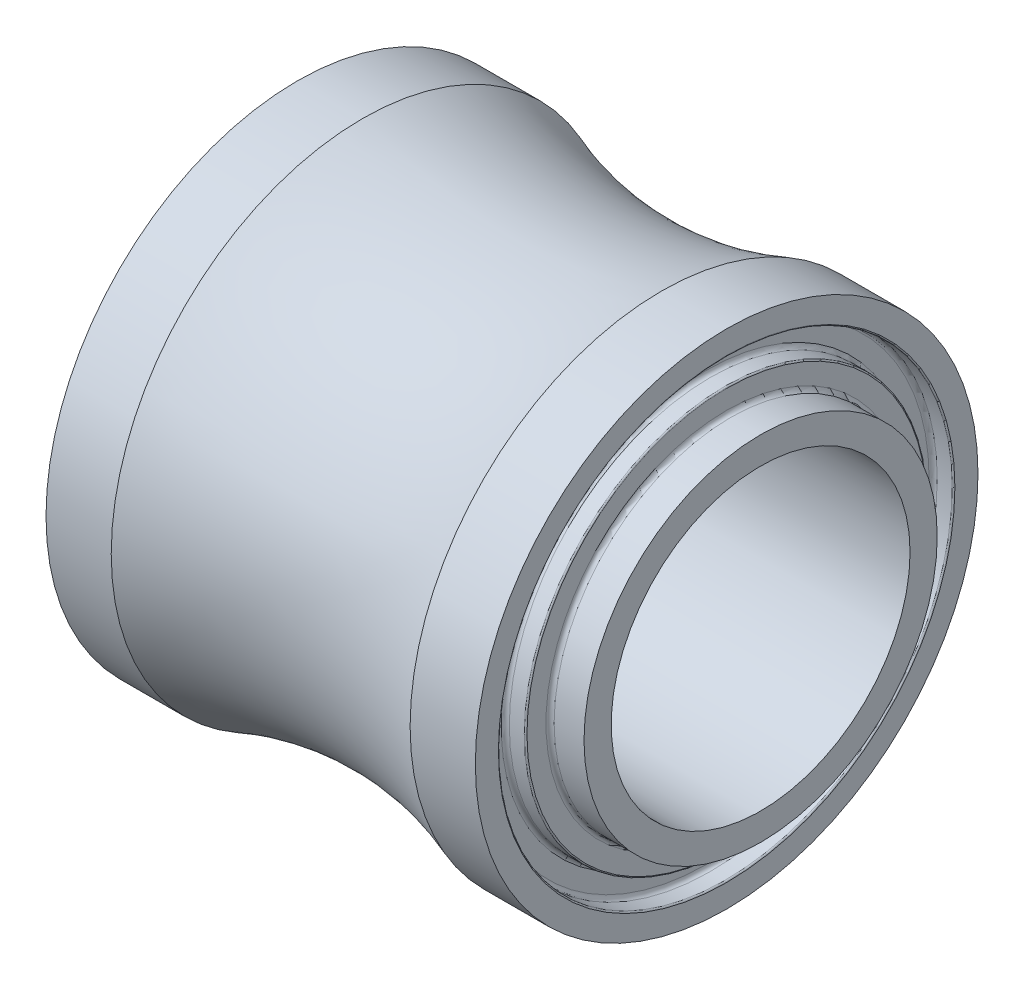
ISO-10303-21;
HEADER;
FILE_DESCRIPTION(('STEP AP214'),'2;1');
FILE_NAME('part.step','',(''),(''),'','','');
FILE_SCHEMA(('AUTOMOTIVE_DESIGN { 1 0 10303 214 1 1 1 1 }'));
ENDSEC;
DATA;
#1=APPLICATION_CONTEXT('core data for automotive mechanical design processes');
#2=APPLICATION_PROTOCOL_DEFINITION('international standard','automotive_design',2000,#1);
#3=PRODUCT_CONTEXT('',#1,'mechanical');
#4=PRODUCT('Part','Part','',(#3));
#5=PRODUCT_RELATED_PRODUCT_CATEGORY('part','',(#4));
#6=PRODUCT_DEFINITION_FORMATION('','',#4);
#7=PRODUCT_DEFINITION_CONTEXT('part definition',#1,'design');
#8=PRODUCT_DEFINITION('design','',#6,#7);
#9=PRODUCT_DEFINITION_SHAPE('','',#8);
#10=(LENGTH_UNIT() NAMED_UNIT(*) SI_UNIT(.MILLI.,.METRE.));
#11=(NAMED_UNIT(*) PLANE_ANGLE_UNIT() SI_UNIT($,.RADIAN.));
#12=(NAMED_UNIT(*) SI_UNIT($,.STERADIAN.) SOLID_ANGLE_UNIT());
#13=UNCERTAINTY_MEASURE_WITH_UNIT(LENGTH_MEASURE(1.E-05),#10,'distance_accuracy_value','');
#14=(GEOMETRIC_REPRESENTATION_CONTEXT(3) GLOBAL_UNCERTAINTY_ASSIGNED_CONTEXT((#13)) GLOBAL_UNIT_ASSIGNED_CONTEXT((#10,
#11,#12)) REPRESENTATION_CONTEXT('',''));
#15=CARTESIAN_POINT('',(0.,0.,0.));
#16=DIRECTION('',(0.,0.,1.));
#17=DIRECTION('',(1.,0.,0.));
#18=AXIS2_PLACEMENT_3D('',#15,#16,#17);
#19=CARTESIAN_POINT('',(-15.8,0.,0.));
#20=DIRECTION('',(1.,0.,0.));
#21=DIRECTION('',(0.,0.,-1.));
#22=AXIS2_PLACEMENT_3D('',#19,#20,#21);
#23=CYLINDRICAL_SURFACE('',#22,18.5);
#24=CARTESIAN_POINT('',(-15.8,0.,0.));
#25=DIRECTION('',(1.,0.,0.));
#26=DIRECTION('',(0.,0.,-1.));
#27=AXIS2_PLACEMENT_3D('',#24,#25,#26);
#28=CIRCLE('',#27,18.5);
#29=CARTESIAN_POINT('',(-15.8,0.,-18.5));
#30=VERTEX_POINT('',#29);
#31=EDGE_CURVE('E358',#30,#30,#28,.T.);
#32=ORIENTED_EDGE('',*,*,#31,.T.);
#33=EDGE_LOOP('',(#32));
#34=FACE_BOUND('',#33,.T.);
#35=CARTESIAN_POINT('',(-10.9999999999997,0.,0.));
#36=DIRECTION('',(1.,0.,0.));
#37=DIRECTION('',(0.,-1.,0.));
#38=AXIS2_PLACEMENT_3D('',#35,#36,#37);
#39=CIRCLE('',#38,18.5000000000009);
#40=CARTESIAN_POINT('',(-10.9999999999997,-18.5000000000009,0.));
#41=VERTEX_POINT('',#40);
#42=EDGE_CURVE('E361',#41,#41,#39,.F.);
#43=ORIENTED_EDGE('',*,*,#42,.T.);
#44=EDGE_LOOP('',(#43));
#45=FACE_BOUND('',#44,.T.);
#46=ADVANCED_FACE('F14',(#34,#45),#23,.T.);
#47=CARTESIAN_POINT('',(0.,0.,0.));
#48=DIRECTION('',(1.,0.,0.));
#49=DIRECTION('',(0.,-1.,0.));
#50=AXIS2_PLACEMENT_3D('',#47,#48,#49);
#51=TOROIDAL_SURFACE('',#50,47.80341277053,31.3);
#52=ORIENTED_EDGE('',*,*,#42,.F.);
#53=EDGE_LOOP('',(#52));
#54=FACE_BOUND('',#53,.T.);
#55=CARTESIAN_POINT('',(11.,0.,0.));
#56=DIRECTION('',(1.,0.,0.));
#57=DIRECTION('',(0.,-1.,0.));
#58=AXIS2_PLACEMENT_3D('',#55,#56,#57);
#59=CIRCLE('',#58,18.5);
#60=CARTESIAN_POINT('',(11.,-18.5,0.));
#61=VERTEX_POINT('',#60);
#62=EDGE_CURVE('E99',#61,#61,#59,.T.);
#63=ORIENTED_EDGE('',*,*,#62,.F.);
#64=EDGE_LOOP('',(#63));
#65=FACE_BOUND('',#64,.T.);
#66=ADVANCED_FACE('F504',(#54,#65),#51,.F.);
#67=CARTESIAN_POINT('',(-15.8,0.,0.));
#68=DIRECTION('',(1.,0.,0.));
#69=DIRECTION('',(0.,0.,-1.));
#70=AXIS2_PLACEMENT_3D('',#67,#68,#69);
#71=PLANE('',#70);
#72=CARTESIAN_POINT('',(-15.8,0.,0.));
#73=DIRECTION('',(-1.,0.,0.));
#74=DIRECTION('',(0.,1.,0.));
#75=AXIS2_PLACEMENT_3D('',#72,#73,#74);
#76=CIRCLE('',#75,16.79999997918);
#77=CARTESIAN_POINT('',(-15.8,16.799999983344,0.));
#78=VERTEX_POINT('',#77);
#79=CARTESIAN_POINT('',(-15.8,-16.799999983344,0.));
#80=VERTEX_POINT('',#79);
#81=EDGE_CURVE('E91',#78,#80,#76,.T.);
#82=ORIENTED_EDGE('',*,*,#81,.F.);
#83=CARTESIAN_POINT('',(-15.8,0.,0.));
#84=DIRECTION('',(-1.,0.,0.));
#85=DIRECTION('',(0.,-1.,0.));
#86=AXIS2_PLACEMENT_3D('',#83,#84,#85);
#87=CIRCLE('',#86,16.79999998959);
#88=EDGE_CURVE('E97',#80,#78,#87,.T.);
#89=ORIENTED_EDGE('',*,*,#88,.F.);
#90=EDGE_LOOP('',(#82,#89));
#91=FACE_BOUND('',#90,.T.);
#92=ORIENTED_EDGE('',*,*,#31,.F.);
#93=EDGE_LOOP('',(#92));
#94=FACE_BOUND('',#93,.T.);
#95=ADVANCED_FACE('F95',(#91,#94),#71,.F.);
#96=CARTESIAN_POINT('',(11.,0.,0.));
#97=DIRECTION('',(1.,0.,0.));
#98=DIRECTION('',(0.,0.,-1.));
#99=AXIS2_PLACEMENT_3D('',#96,#97,#98);
#100=CYLINDRICAL_SURFACE('',#99,18.5);
#101=ORIENTED_EDGE('',*,*,#62,.T.);
#102=EDGE_LOOP('',(#101));
#103=FACE_BOUND('',#102,.T.);
#104=CARTESIAN_POINT('',(15.8,0.,0.));
#105=DIRECTION('',(1.,0.,0.));
#106=DIRECTION('',(0.,0.,-1.));
#107=AXIS2_PLACEMENT_3D('',#104,#105,#106);
#108=CIRCLE('',#107,18.5);
#109=CARTESIAN_POINT('',(15.8,0.,-18.5));
#110=VERTEX_POINT('',#109);
#111=EDGE_CURVE('E104',#110,#110,#108,.T.);
#112=ORIENTED_EDGE('',*,*,#111,.F.);
#113=EDGE_LOOP('',(#112));
#114=FACE_BOUND('',#113,.T.);
#115=ADVANCED_FACE('F124',(#103,#114),#100,.T.);
#116=CARTESIAN_POINT('',(-15.7,0.,0.));
#117=DIRECTION('',(-1.,0.,0.));
#118=DIRECTION('',(0.,0.999965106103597,-0.00835383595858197));
#119=AXIS2_PLACEMENT_3D('',#116,#117,#118);
#120=TOROIDAL_SURFACE('',#119,16.8,0.1);
#121=CARTESIAN_POINT('',(-15.7,0.,0.));
#122=DIRECTION('',(-1.,0.,0.));
#123=DIRECTION('',(0.,1.,0.));
#124=AXIS2_PLACEMENT_3D('',#121,#122,#123);
#125=CIRCLE('',#124,16.7);
#126=CARTESIAN_POINT('',(-15.7,16.7,0.));
#127=VERTEX_POINT('',#126);
#128=EDGE_CURVE('E107',#127,#127,#125,.F.);
#129=ORIENTED_EDGE('',*,*,#128,.T.);
#130=EDGE_LOOP('',(#129));
#131=FACE_BOUND('',#130,.T.);
#132=ORIENTED_EDGE('',*,*,#88,.T.);
#133=ORIENTED_EDGE('',*,*,#81,.T.);
#134=EDGE_LOOP('',(#132,#133));
#135=FACE_BOUND('',#134,.T.);
#136=ADVANCED_FACE('F103',(#131,#135),#120,.T.);
#137=CARTESIAN_POINT('',(15.8,0.,0.));
#138=DIRECTION('',(1.,0.,0.));
#139=DIRECTION('',(0.,0.,-1.));
#140=AXIS2_PLACEMENT_3D('',#137,#138,#139);
#141=PLANE('',#140);
#142=CARTESIAN_POINT('',(15.8,0.,0.));
#143=DIRECTION('',(1.,0.,0.));
#144=DIRECTION('',(0.,-1.,0.));
#145=AXIS2_PLACEMENT_3D('',#142,#143,#144);
#146=CIRCLE('',#145,16.79999998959);
#147=CARTESIAN_POINT('',(15.8,-16.799999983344,0.));
#148=VERTEX_POINT('',#147);
#149=CARTESIAN_POINT('',(15.8,16.799999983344,0.));
#150=VERTEX_POINT('',#149);
#151=EDGE_CURVE('E139',#148,#150,#146,.T.);
#152=ORIENTED_EDGE('',*,*,#151,.F.);
#153=CARTESIAN_POINT('',(15.8,0.,0.));
#154=DIRECTION('',(1.,0.,0.));
#155=DIRECTION('',(0.,1.,0.));
#156=AXIS2_PLACEMENT_3D('',#153,#154,#155);
#157=CIRCLE('',#156,16.79999997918);
#158=EDGE_CURVE('E149',#150,#148,#157,.T.);
#159=ORIENTED_EDGE('',*,*,#158,.F.);
#160=EDGE_LOOP('',(#152,#159));
#161=FACE_BOUND('',#160,.T.);
#162=ORIENTED_EDGE('',*,*,#111,.T.);
#163=EDGE_LOOP('',(#162));
#164=FACE_BOUND('',#163,.T.);
#165=ADVANCED_FACE('F123',(#161,#164),#141,.T.);
#166=CARTESIAN_POINT('',(-14.6,0.,0.));
#167=DIRECTION('',(-1.,0.,0.));
#168=DIRECTION('',(0.,0.,1.));
#169=AXIS2_PLACEMENT_3D('',#166,#167,#168);
#170=CYLINDRICAL_SURFACE('',#169,16.7);
#171=CARTESIAN_POINT('',(-14.6,0.,0.));
#172=DIRECTION('',(-1.,0.,0.));
#173=DIRECTION('',(0.,-0.999981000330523,-0.00616433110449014));
#174=AXIS2_PLACEMENT_3D('',#171,#172,#173);
#175=CIRCLE('',#174,16.7);
#176=CARTESIAN_POINT('',(-14.6,-16.6996827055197,-0.102944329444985));
#177=VERTEX_POINT('',#176);
#178=EDGE_CURVE('E346',#177,#177,#175,.F.);
#179=ORIENTED_EDGE('',*,*,#178,.T.);
#180=EDGE_LOOP('',(#179));
#181=FACE_BOUND('',#180,.T.);
#182=ORIENTED_EDGE('',*,*,#128,.F.);
#183=EDGE_LOOP('',(#182));
#184=FACE_BOUND('',#183,.T.);
#185=ADVANCED_FACE('F168',(#181,#184),#170,.F.);
#186=CARTESIAN_POINT('',(15.7,0.,0.));
#187=DIRECTION('',(-1.,0.,0.));
#188=DIRECTION('',(0.,0.999982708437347,0.00588071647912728));
#189=AXIS2_PLACEMENT_3D('',#186,#187,#188);
#190=TOROIDAL_SURFACE('',#189,16.8,0.1);
#191=CARTESIAN_POINT('',(15.7,0.,0.));
#192=DIRECTION('',(-1.,0.,0.));
#193=DIRECTION('',(0.,1.,0.));
#194=AXIS2_PLACEMENT_3D('',#191,#192,#193);
#195=CIRCLE('',#194,16.7);
#196=CARTESIAN_POINT('',(15.7,16.7,0.));
#197=VERTEX_POINT('',#196);
#198=EDGE_CURVE('E338',#197,#197,#195,.T.);
#199=ORIENTED_EDGE('',*,*,#198,.T.);
#200=EDGE_LOOP('',(#199));
#201=FACE_BOUND('',#200,.T.);
#202=ORIENTED_EDGE('',*,*,#151,.T.);
#203=ORIENTED_EDGE('',*,*,#158,.T.);
#204=EDGE_LOOP('',(#202,#203));
#205=FACE_BOUND('',#204,.T.);
#206=ADVANCED_FACE('F163',(#201,#205),#190,.T.);
#207=CARTESIAN_POINT('',(-14.6,0.,0.));
#208=DIRECTION('',(-1.,0.,0.));
#209=DIRECTION('',(0.,-0.999981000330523,-0.00616433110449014));
#210=AXIS2_PLACEMENT_3D('',#207,#208,#209);
#211=TOROIDAL_SURFACE('',#210,16.4,0.3);
#212=CARTESIAN_POINT('',(-14.3,0.,0.));
#213=DIRECTION('',(1.,0.,0.));
#214=DIRECTION('',(0.,1.,0.));
#215=AXIS2_PLACEMENT_3D('',#212,#213,#214);
#216=CIRCLE('',#215,16.40000001);
#217=CARTESIAN_POINT('',(-14.3,-16.400000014,0.));
#218=VERTEX_POINT('',#217);
#219=CARTESIAN_POINT('',(-14.3,16.400000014,0.));
#220=VERTEX_POINT('',#219);
#221=EDGE_CURVE('E326',#218,#220,#216,.F.);
#222=ORIENTED_EDGE('',*,*,#221,.F.);
#223=CARTESIAN_POINT('',(-14.3,0.,0.));
#224=DIRECTION('',(1.,0.,0.));
#225=DIRECTION('',(0.,-1.,0.));
#226=AXIS2_PLACEMENT_3D('',#223,#224,#225);
#227=CIRCLE('',#226,16.40000002);
#228=EDGE_CURVE('E198',#220,#218,#227,.F.);
#229=ORIENTED_EDGE('',*,*,#228,.F.);
#230=EDGE_LOOP('',(#222,#229));
#231=FACE_BOUND('',#230,.T.);
#232=ORIENTED_EDGE('',*,*,#178,.F.);
#233=EDGE_LOOP('',(#232));
#234=FACE_BOUND('',#233,.T.);
#235=ADVANCED_FACE('F167',(#231,#234),#211,.F.);
#236=CARTESIAN_POINT('',(15.7,0.,0.));
#237=DIRECTION('',(-1.,0.,0.));
#238=DIRECTION('',(0.,0.,1.));
#239=AXIS2_PLACEMENT_3D('',#236,#237,#238);
#240=CYLINDRICAL_SURFACE('',#239,16.7);
#241=CARTESIAN_POINT('',(14.6,0.,0.));
#242=DIRECTION('',(-1.,0.,0.));
#243=DIRECTION('',(0.,-0.999984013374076,0.00565446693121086));
#244=AXIS2_PLACEMENT_3D('',#241,#242,#243);
#245=CIRCLE('',#244,16.7);
#246=CARTESIAN_POINT('',(14.6,-16.6997330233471,0.0944295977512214));
#247=VERTEX_POINT('',#246);
#248=EDGE_CURVE('E324',#247,#247,#245,.T.);
#249=ORIENTED_EDGE('',*,*,#248,.T.);
#250=EDGE_LOOP('',(#249));
#251=FACE_BOUND('',#250,.T.);
#252=ORIENTED_EDGE('',*,*,#198,.F.);
#253=EDGE_LOOP('',(#252));
#254=FACE_BOUND('',#253,.T.);
#255=ADVANCED_FACE('F677',(#251,#254),#240,.F.);
#256=CARTESIAN_POINT('',(-14.3,0.,0.));
#257=DIRECTION('',(-1.,0.,0.));
#258=DIRECTION('',(0.,0.,1.));
#259=AXIS2_PLACEMENT_3D('',#256,#257,#258);
#260=PLANE('',#259);
#261=CARTESIAN_POINT('',(-14.3,0.,0.));
#262=DIRECTION('',(-1.,0.,0.));
#263=DIRECTION('',(0.,1.,0.));
#264=AXIS2_PLACEMENT_3D('',#261,#262,#263);
#265=CIRCLE('',#264,15.0999999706);
#266=CARTESIAN_POINT('',(-14.3,-15.09999997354,0.));
#267=VERTEX_POINT('',#266);
#268=CARTESIAN_POINT('',(-14.3,15.09999997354,0.));
#269=VERTEX_POINT('',#268);
#270=EDGE_CURVE('E312',#267,#269,#265,.F.);
#271=ORIENTED_EDGE('',*,*,#270,.T.);
#272=CARTESIAN_POINT('',(-14.3,0.,0.));
#273=DIRECTION('',(-1.,0.,0.));
#274=DIRECTION('',(0.,-1.,0.));
#275=AXIS2_PLACEMENT_3D('',#272,#273,#274);
#276=CIRCLE('',#275,15.0999999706);
#277=EDGE_CURVE('E320',#269,#267,#276,.F.);
#278=ORIENTED_EDGE('',*,*,#277,.T.);
#279=EDGE_LOOP('',(#271,#278));
#280=FACE_BOUND('',#279,.T.);
#281=ORIENTED_EDGE('',*,*,#228,.T.);
#282=ORIENTED_EDGE('',*,*,#221,.T.);
#283=EDGE_LOOP('',(#281,#282));
#284=FACE_BOUND('',#283,.T.);
#285=ADVANCED_FACE('F217',(#280,#284),#260,.T.);
#286=CARTESIAN_POINT('',(14.6,0.,0.));
#287=DIRECTION('',(-1.,0.,0.));
#288=DIRECTION('',(0.,-0.999984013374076,0.00565446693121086));
#289=AXIS2_PLACEMENT_3D('',#286,#287,#288);
#290=TOROIDAL_SURFACE('',#289,16.4,0.3);
#291=CARTESIAN_POINT('',(14.3,0.,0.));
#292=DIRECTION('',(-1.,0.,0.));
#293=DIRECTION('',(0.,1.,0.));
#294=AXIS2_PLACEMENT_3D('',#291,#292,#293);
#295=CIRCLE('',#294,16.40000001);
#296=CARTESIAN_POINT('',(14.3,16.400000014,0.));
#297=VERTEX_POINT('',#296);
#298=CARTESIAN_POINT('',(14.3,-16.400000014,0.));
#299=VERTEX_POINT('',#298);
#300=EDGE_CURVE('E814',#297,#299,#295,.T.);
#301=ORIENTED_EDGE('',*,*,#300,.T.);
#302=CARTESIAN_POINT('',(14.3,0.,0.));
#303=DIRECTION('',(-1.,0.,0.));
#304=DIRECTION('',(0.,-1.,0.));
#305=AXIS2_PLACEMENT_3D('',#302,#303,#304);
#306=CIRCLE('',#305,16.40000002);
#307=EDGE_CURVE('E236',#299,#297,#306,.T.);
#308=ORIENTED_EDGE('',*,*,#307,.T.);
#309=EDGE_LOOP('',(#301,#308));
#310=FACE_BOUND('',#309,.T.);
#311=ORIENTED_EDGE('',*,*,#248,.F.);
#312=EDGE_LOOP('',(#311));
#313=FACE_BOUND('',#312,.T.);
#314=ADVANCED_FACE('F205',(#310,#313),#290,.F.);
#315=CARTESIAN_POINT('',(-14.6,0.,0.));
#316=DIRECTION('',(-1.,0.,0.));
#317=DIRECTION('',(0.,-0.999977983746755,-0.0066356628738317));
#318=AXIS2_PLACEMENT_3D('',#315,#316,#317);
#319=TOROIDAL_SURFACE('',#318,15.1,0.3);
#320=CARTESIAN_POINT('',(-14.6,0.,0.));
#321=DIRECTION('',(-1.,0.,0.));
#322=DIRECTION('',(0.,1.,0.));
#323=AXIS2_PLACEMENT_3D('',#320,#321,#322);
#324=CIRCLE('',#323,14.8);
#325=CARTESIAN_POINT('',(-14.6,14.8,0.));
#326=VERTEX_POINT('',#325);
#327=EDGE_CURVE('E812',#326,#326,#324,.T.);
#328=ORIENTED_EDGE('',*,*,#327,.F.);
#329=EDGE_LOOP('',(#328));
#330=FACE_BOUND('',#329,.T.);
#331=ORIENTED_EDGE('',*,*,#270,.F.);
#332=ORIENTED_EDGE('',*,*,#277,.F.);
#333=EDGE_LOOP('',(#331,#332));
#334=FACE_BOUND('',#333,.T.);
#335=ADVANCED_FACE('F216',(#330,#334),#319,.F.);
#336=CARTESIAN_POINT('',(14.3,0.,0.));
#337=DIRECTION('',(-1.,0.,0.));
#338=DIRECTION('',(0.,0.,1.));
#339=AXIS2_PLACEMENT_3D('',#336,#337,#338);
#340=PLANE('',#339);
#341=CARTESIAN_POINT('',(14.3,0.,0.));
#342=DIRECTION('',(1.,0.,0.));
#343=DIRECTION('',(0.,1.,0.));
#344=AXIS2_PLACEMENT_3D('',#341,#342,#343);
#345=CIRCLE('',#344,15.09999997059);
#346=CARTESIAN_POINT('',(14.3,-15.099999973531,0.));
#347=VERTEX_POINT('',#346);
#348=CARTESIAN_POINT('',(14.3,15.099999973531,0.));
#349=VERTEX_POINT('',#348);
#350=EDGE_CURVE('E810',#347,#349,#345,.F.);
#351=ORIENTED_EDGE('',*,*,#350,.T.);
#352=CARTESIAN_POINT('',(14.3,0.,0.));
#353=DIRECTION('',(1.,0.,0.));
#354=DIRECTION('',(0.,-1.,0.));
#355=AXIS2_PLACEMENT_3D('',#352,#353,#354);
#356=CIRCLE('',#355,15.09999997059);
#357=EDGE_CURVE('E270',#349,#347,#356,.F.);
#358=ORIENTED_EDGE('',*,*,#357,.T.);
#359=EDGE_LOOP('',(#351,#358));
#360=FACE_BOUND('',#359,.T.);
#361=ORIENTED_EDGE('',*,*,#307,.F.);
#362=ORIENTED_EDGE('',*,*,#300,.F.);
#363=EDGE_LOOP('',(#361,#362));
#364=FACE_BOUND('',#363,.T.);
#365=ADVANCED_FACE('F241',(#360,#364),#340,.F.);
#366=CARTESIAN_POINT('',(-14.6,0.,0.));
#367=DIRECTION('',(-1.,0.,0.));
#368=DIRECTION('',(0.,0.,1.));
#369=AXIS2_PLACEMENT_3D('',#366,#367,#368);
#370=CYLINDRICAL_SURFACE('',#369,14.8);
#371=ORIENTED_EDGE('',*,*,#327,.T.);
#372=EDGE_LOOP('',(#371));
#373=FACE_BOUND('',#372,.T.);
#374=CARTESIAN_POINT('',(-15.7,0.,0.));
#375=DIRECTION('',(-1.,0.,0.));
#376=DIRECTION('',(0.,-0.999977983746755,-0.0066356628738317));
#377=AXIS2_PLACEMENT_3D('',#374,#375,#376);
#378=CIRCLE('',#377,14.8);
#379=CARTESIAN_POINT('',(-15.7,-14.799674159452,-0.0982078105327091));
#380=VERTEX_POINT('',#379);
#381=EDGE_CURVE('E808',#380,#380,#378,.T.);
#382=ORIENTED_EDGE('',*,*,#381,.F.);
#383=EDGE_LOOP('',(#382));
#384=FACE_BOUND('',#383,.T.);
#385=ADVANCED_FACE('F250',(#373,#384),#370,.T.);
#386=CARTESIAN_POINT('',(14.6,0.,0.));
#387=DIRECTION('',(-1.,0.,0.));
#388=DIRECTION('',(0.,0.999955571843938,-0.00942625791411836));
#389=AXIS2_PLACEMENT_3D('',#386,#387,#388);
#390=TOROIDAL_SURFACE('',#389,15.1,0.3);
#391=CARTESIAN_POINT('',(14.6,0.,0.));
#392=DIRECTION('',(-1.,0.,0.));
#393=DIRECTION('',(0.,1.,0.));
#394=AXIS2_PLACEMENT_3D('',#391,#392,#393);
#395=CIRCLE('',#394,14.8);
#396=CARTESIAN_POINT('',(14.6,14.8,0.));
#397=VERTEX_POINT('',#396);
#398=EDGE_CURVE('E763',#397,#397,#395,.F.);
#399=ORIENTED_EDGE('',*,*,#398,.F.);
#400=EDGE_LOOP('',(#399));
#401=FACE_BOUND('',#400,.T.);
#402=ORIENTED_EDGE('',*,*,#357,.F.);
#403=ORIENTED_EDGE('',*,*,#350,.F.);
#404=EDGE_LOOP('',(#402,#403));
#405=FACE_BOUND('',#404,.T.);
#406=ADVANCED_FACE('F284',(#401,#405),#390,.F.);
#407=CARTESIAN_POINT('',(-15.7,0.,0.));
#408=DIRECTION('',(-1.,0.,0.));
#409=DIRECTION('',(0.,-0.999977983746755,-0.0066356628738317));
#410=AXIS2_PLACEMENT_3D('',#407,#408,#409);
#411=TOROIDAL_SURFACE('',#410,14.7,0.1);
#412=ORIENTED_EDGE('',*,*,#381,.T.);
#413=EDGE_LOOP('',(#412));
#414=FACE_BOUND('',#413,.T.);
#415=CARTESIAN_POINT('',(-15.8,0.,0.));
#416=DIRECTION('',(1.,0.,0.));
#417=DIRECTION('',(0.,1.,0.));
#418=AXIS2_PLACEMENT_3D('',#415,#416,#417);
#419=CIRCLE('',#418,14.69999998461);
#420=CARTESIAN_POINT('',(-15.8,14.699999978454,0.));
#421=VERTEX_POINT('',#420);
#422=CARTESIAN_POINT('',(-15.8,-14.699999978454,0.));
#423=VERTEX_POINT('',#422);
#424=EDGE_CURVE('E759',#421,#423,#419,.T.);
#425=ORIENTED_EDGE('',*,*,#424,.T.);
#426=CARTESIAN_POINT('',(-15.8,0.,0.));
#427=DIRECTION('',(1.,0.,0.));
#428=DIRECTION('',(0.,-1.,0.));
#429=AXIS2_PLACEMENT_3D('',#426,#427,#428);
#430=CIRCLE('',#429,14.69999996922);
#431=EDGE_CURVE('E758',#423,#421,#430,.T.);
#432=ORIENTED_EDGE('',*,*,#431,.T.);
#433=EDGE_LOOP('',(#425,#432));
#434=FACE_BOUND('',#433,.T.);
#435=ADVANCED_FACE('F288',(#414,#434),#411,.T.);
#436=CARTESIAN_POINT('',(15.7,0.,0.));
#437=DIRECTION('',(-1.,0.,0.));
#438=DIRECTION('',(0.,0.,1.));
#439=AXIS2_PLACEMENT_3D('',#436,#437,#438);
#440=CYLINDRICAL_SURFACE('',#439,14.8);
#441=ORIENTED_EDGE('',*,*,#398,.T.);
#442=EDGE_LOOP('',(#441));
#443=FACE_BOUND('',#442,.T.);
#444=CARTESIAN_POINT('',(15.7,0.,0.));
#445=DIRECTION('',(-1.,0.,0.));
#446=DIRECTION('',(0.,0.999955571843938,-0.00942625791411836));
#447=AXIS2_PLACEMENT_3D('',#444,#445,#446);
#448=CIRCLE('',#447,14.8);
#449=CARTESIAN_POINT('',(15.7,14.7993424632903,-0.139508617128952));
#450=VERTEX_POINT('',#449);
#451=EDGE_CURVE('E790',#450,#450,#448,.F.);
#452=ORIENTED_EDGE('',*,*,#451,.F.);
#453=EDGE_LOOP('',(#452));
#454=FACE_BOUND('',#453,.T.);
#455=ADVANCED_FACE('F623',(#443,#454),#440,.T.);
#456=CARTESIAN_POINT('',(-15.8,0.,0.));
#457=DIRECTION('',(1.,0.,0.));
#458=DIRECTION('',(0.,0.,-1.));
#459=AXIS2_PLACEMENT_3D('',#456,#457,#458);
#460=PLANE('',#459);
#461=CARTESIAN_POINT('',(-15.8,0.,0.));
#462=DIRECTION('',(-1.,0.,0.));
#463=DIRECTION('',(0.,1.,0.));
#464=AXIS2_PLACEMENT_3D('',#461,#462,#463);
#465=CIRCLE('',#464,13.30000000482);
#466=CARTESIAN_POINT('',(-15.8,-13.300000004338,0.));
#467=VERTEX_POINT('',#466);
#468=CARTESIAN_POINT('',(-15.8,13.300000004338,0.));
#469=VERTEX_POINT('',#468);
#470=EDGE_CURVE('E754',#467,#469,#465,.F.);
#471=ORIENTED_EDGE('',*,*,#470,.T.);
#472=CARTESIAN_POINT('',(-15.8,0.,0.));
#473=DIRECTION('',(-1.,0.,0.));
#474=DIRECTION('',(0.,-1.,0.));
#475=AXIS2_PLACEMENT_3D('',#472,#473,#474);
#476=CIRCLE('',#475,13.30000000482);
#477=EDGE_CURVE('E788',#469,#467,#476,.F.);
#478=ORIENTED_EDGE('',*,*,#477,.T.);
#479=EDGE_LOOP('',(#471,#478));
#480=FACE_BOUND('',#479,.T.);
#481=ORIENTED_EDGE('',*,*,#431,.F.);
#482=ORIENTED_EDGE('',*,*,#424,.F.);
#483=EDGE_LOOP('',(#481,#482));
#484=FACE_BOUND('',#483,.T.);
#485=ADVANCED_FACE('F433',(#480,#484),#460,.F.);
#486=CARTESIAN_POINT('',(15.7,0.,0.));
#487=DIRECTION('',(-1.,0.,0.));
#488=DIRECTION('',(0.,0.999955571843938,-0.00942625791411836));
#489=AXIS2_PLACEMENT_3D('',#486,#487,#488);
#490=TOROIDAL_SURFACE('',#489,14.7,0.1);
#491=ORIENTED_EDGE('',*,*,#451,.T.);
#492=EDGE_LOOP('',(#491));
#493=FACE_BOUND('',#492,.T.);
#494=CARTESIAN_POINT('',(15.8,0.,0.));
#495=DIRECTION('',(-1.,0.,0.));
#496=DIRECTION('',(0.,-1.,0.));
#497=AXIS2_PLACEMENT_3D('',#494,#495,#496);
#498=CIRCLE('',#497,14.699999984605);
#499=CARTESIAN_POINT('',(15.8,14.699999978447,0.));
#500=VERTEX_POINT('',#499);
#501=CARTESIAN_POINT('',(15.8,-14.699999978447,0.));
#502=VERTEX_POINT('',#501);
#503=EDGE_CURVE('E410',#500,#502,#498,.F.);
#504=ORIENTED_EDGE('',*,*,#503,.F.);
#505=CARTESIAN_POINT('',(15.8,0.,0.));
#506=DIRECTION('',(-1.,0.,0.));
#507=DIRECTION('',(0.,1.,0.));
#508=AXIS2_PLACEMENT_3D('',#505,#506,#507);
#509=CIRCLE('',#508,14.69999996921);
#510=EDGE_CURVE('E448',#502,#500,#509,.F.);
#511=ORIENTED_EDGE('',*,*,#510,.F.);
#512=EDGE_LOOP('',(#504,#511));
#513=FACE_BOUND('',#512,.T.);
#514=ADVANCED_FACE('F421',(#493,#513),#490,.T.);
#515=CARTESIAN_POINT('',(-16.1,0.,0.));
#516=DIRECTION('',(1.,0.,0.));
#517=DIRECTION('',(0.,0.99996864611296,-0.00791876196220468));
#518=AXIS2_PLACEMENT_3D('',#515,#516,#517);
#519=TOROIDAL_SURFACE('',#518,13.3,0.3);
#520=ORIENTED_EDGE('',*,*,#477,.F.);
#521=ORIENTED_EDGE('',*,*,#470,.F.);
#522=EDGE_LOOP('',(#520,#521));
#523=FACE_BOUND('',#522,.T.);
#524=CARTESIAN_POINT('',(-16.1,0.,0.));
#525=DIRECTION('',(1.,0.,0.));
#526=DIRECTION('',(0.,-1.,0.));
#527=AXIS2_PLACEMENT_3D('',#524,#525,#526);
#528=CIRCLE('',#527,13.);
#529=CARTESIAN_POINT('',(-16.1,-13.,0.));
#530=VERTEX_POINT('',#529);
#531=EDGE_CURVE('E402',#530,#530,#528,.F.);
#532=ORIENTED_EDGE('',*,*,#531,.F.);
#533=EDGE_LOOP('',(#532));
#534=FACE_BOUND('',#533,.T.);
#535=ADVANCED_FACE('F432',(#523,#534),#519,.F.);
#536=CARTESIAN_POINT('',(15.8,0.,0.));
#537=DIRECTION('',(1.,0.,0.));
#538=DIRECTION('',(0.,0.,-1.));
#539=AXIS2_PLACEMENT_3D('',#536,#537,#538);
#540=PLANE('',#539);
#541=CARTESIAN_POINT('',(15.8,0.,0.));
#542=DIRECTION('',(1.,0.,0.));
#543=DIRECTION('',(0.,-1.,0.));
#544=AXIS2_PLACEMENT_3D('',#541,#542,#543);
#545=CIRCLE('',#544,13.29999993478);
#546=CARTESIAN_POINT('',(15.8,13.299999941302,0.));
#547=VERTEX_POINT('',#546);
#548=CARTESIAN_POINT('',(15.8,-13.299999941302,0.));
#549=VERTEX_POINT('',#548);
#550=EDGE_CURVE('E34',#547,#549,#545,.F.);
#551=ORIENTED_EDGE('',*,*,#550,.T.);
#552=CARTESIAN_POINT('',(15.8,0.,0.));
#553=DIRECTION('',(1.,0.,0.));
#554=DIRECTION('',(0.,1.,0.));
#555=AXIS2_PLACEMENT_3D('',#552,#553,#554);
#556=CIRCLE('',#555,13.29999993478);
#557=EDGE_CURVE('E364',#549,#547,#556,.F.);
#558=ORIENTED_EDGE('',*,*,#557,.T.);
#559=EDGE_LOOP('',(#551,#558));
#560=FACE_BOUND('',#559,.T.);
#561=ORIENTED_EDGE('',*,*,#510,.T.);
#562=ORIENTED_EDGE('',*,*,#503,.T.);
#563=EDGE_LOOP('',(#561,#562));
#564=FACE_BOUND('',#563,.T.);
#565=ADVANCED_FACE('F453',(#560,#564),#540,.T.);
#566=CARTESIAN_POINT('',(-18.3,0.,0.));
#567=DIRECTION('',(1.,0.,0.));
#568=DIRECTION('',(0.,0.,-1.));
#569=AXIS2_PLACEMENT_3D('',#566,#567,#568);
#570=CYLINDRICAL_SURFACE('',#569,13.);
#571=CARTESIAN_POINT('',(-18.3,0.,0.));
#572=DIRECTION('',(1.,0.,0.));
#573=DIRECTION('',(0.,0.,-1.));
#574=AXIS2_PLACEMENT_3D('',#571,#572,#573);
#575=CIRCLE('',#574,13.);
#576=CARTESIAN_POINT('',(-18.3,0.,-13.));
#577=VERTEX_POINT('',#576);
#578=EDGE_CURVE('E356',#577,#577,#575,.T.);
#579=ORIENTED_EDGE('',*,*,#578,.T.);
#580=EDGE_LOOP('',(#579));
#581=FACE_BOUND('',#580,.T.);
#582=ORIENTED_EDGE('',*,*,#531,.T.);
#583=EDGE_LOOP('',(#582));
#584=FACE_BOUND('',#583,.T.);
#585=ADVANCED_FACE('F383',(#581,#584),#570,.T.);
#586=CARTESIAN_POINT('',(16.1,0.,0.));
#587=DIRECTION('',(1.,0.,0.));
#588=DIRECTION('',(0.,-0.999971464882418,0.00755443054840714));
#589=AXIS2_PLACEMENT_3D('',#586,#587,#588);
#590=TOROIDAL_SURFACE('',#589,13.3,0.3);
#591=CARTESIAN_POINT('',(16.1,0.,0.));
#592=DIRECTION('',(1.,0.,0.));
#593=DIRECTION('',(0.,-1.,0.));
#594=AXIS2_PLACEMENT_3D('',#591,#592,#593);
#595=CIRCLE('',#594,13.);
#596=CARTESIAN_POINT('',(16.1,-13.,0.));
#597=VERTEX_POINT('',#596);
#598=EDGE_CURVE('E395',#597,#597,#595,.T.);
#599=ORIENTED_EDGE('',*,*,#598,.F.);
#600=EDGE_LOOP('',(#599));
#601=FACE_BOUND('',#600,.T.);
#602=ORIENTED_EDGE('',*,*,#557,.F.);
#603=ORIENTED_EDGE('',*,*,#550,.F.);
#604=EDGE_LOOP('',(#602,#603));
#605=FACE_BOUND('',#604,.T.);
#606=ADVANCED_FACE('F371',(#601,#605),#590,.F.);
#607=CARTESIAN_POINT('',(-18.3,0.,0.));
#608=DIRECTION('',(1.,0.,0.));
#609=DIRECTION('',(0.,0.,-1.));
#610=AXIS2_PLACEMENT_3D('',#607,#608,#609);
#611=PLANE('',#610);
#612=CARTESIAN_POINT('',(-18.3,0.,0.));
#613=DIRECTION('',(1.,0.,0.));
#614=DIRECTION('',(0.,0.,-1.));
#615=AXIS2_PLACEMENT_3D('',#612,#613,#614);
#616=CIRCLE('',#615,11.);
#617=CARTESIAN_POINT('',(-18.3,0.,-11.));
#618=VERTEX_POINT('',#617);
#619=EDGE_CURVE('E398',#618,#618,#616,.T.);
#620=ORIENTED_EDGE('',*,*,#619,.T.);
#621=EDGE_LOOP('',(#620));
#622=FACE_BOUND('',#621,.T.);
#623=ORIENTED_EDGE('',*,*,#578,.F.);
#624=EDGE_LOOP('',(#623));
#625=FACE_BOUND('',#624,.T.);
#626=ADVANCED_FACE('F382',(#622,#625),#611,.F.);
#627=CARTESIAN_POINT('',(16.1,0.,0.));
#628=DIRECTION('',(1.,0.,0.));
#629=DIRECTION('',(0.,0.,-1.));
#630=AXIS2_PLACEMENT_3D('',#627,#628,#629);
#631=CYLINDRICAL_SURFACE('',#630,13.);
#632=CARTESIAN_POINT('',(18.3,0.,0.));
#633=DIRECTION('',(1.,0.,0.));
#634=DIRECTION('',(0.,0.,-1.));
#635=AXIS2_PLACEMENT_3D('',#632,#633,#634);
#636=CIRCLE('',#635,13.);
#637=CARTESIAN_POINT('',(18.3,0.,-13.));
#638=VERTEX_POINT('',#637);
#639=EDGE_CURVE('E26',#638,#638,#636,.T.);
#640=ORIENTED_EDGE('',*,*,#639,.F.);
#641=EDGE_LOOP('',(#640));
#642=FACE_BOUND('',#641,.T.);
#643=ORIENTED_EDGE('',*,*,#598,.T.);
#644=EDGE_LOOP('',(#643));
#645=FACE_BOUND('',#644,.T.);
#646=ADVANCED_FACE('F480',(#642,#645),#631,.T.);
#647=CARTESIAN_POINT('',(-18.3,0.,0.));
#648=DIRECTION('',(1.,0.,0.));
#649=DIRECTION('',(0.,0.,-1.));
#650=AXIS2_PLACEMENT_3D('',#647,#648,#649);
#651=CYLINDRICAL_SURFACE('',#650,11.);
#652=ORIENTED_EDGE('',*,*,#619,.F.);
#653=EDGE_LOOP('',(#652));
#654=FACE_BOUND('',#653,.T.);
#655=CARTESIAN_POINT('',(18.3,0.,0.));
#656=DIRECTION('',(1.,0.,0.));
#657=DIRECTION('',(0.,0.,-1.));
#658=AXIS2_PLACEMENT_3D('',#655,#656,#657);
#659=CIRCLE('',#658,11.);
#660=CARTESIAN_POINT('',(18.3,0.,-11.));
#661=VERTEX_POINT('',#660);
#662=EDGE_CURVE('E9',#661,#661,#659,.F.);
#663=ORIENTED_EDGE('',*,*,#662,.F.);
#664=EDGE_LOOP('',(#663));
#665=FACE_BOUND('',#664,.T.);
#666=ADVANCED_FACE('F486',(#654,#665),#651,.F.);
#667=CARTESIAN_POINT('',(18.3,0.,0.));
#668=DIRECTION('',(1.,0.,0.));
#669=DIRECTION('',(0.,0.,-1.));
#670=AXIS2_PLACEMENT_3D('',#667,#668,#669);
#671=PLANE('',#670);
#672=ORIENTED_EDGE('',*,*,#662,.T.);
#673=EDGE_LOOP('',(#672));
#674=FACE_BOUND('',#673,.T.);
#675=ORIENTED_EDGE('',*,*,#639,.T.);
#676=EDGE_LOOP('',(#675));
#677=FACE_BOUND('',#676,.T.);
#678=ADVANCED_FACE('F16',(#674,#677),#671,.T.);
#679=CLOSED_SHELL('',(#46,#66,#95,#115,#136,#165,#185,#206,#235,#255,#285,#314,#335,#365,#385,
#406,#435,#455,#485,#514,#535,#565,#585,#606,#626,#646,#666,#678));
#680=MANIFOLD_SOLID_BREP('B1',#679);
#681=ADVANCED_BREP_SHAPE_REPRESENTATION('',(#18,#680),#14);
#682=SHAPE_DEFINITION_REPRESENTATION(#9,#681);
ENDSEC;
END-ISO-10303-21;
